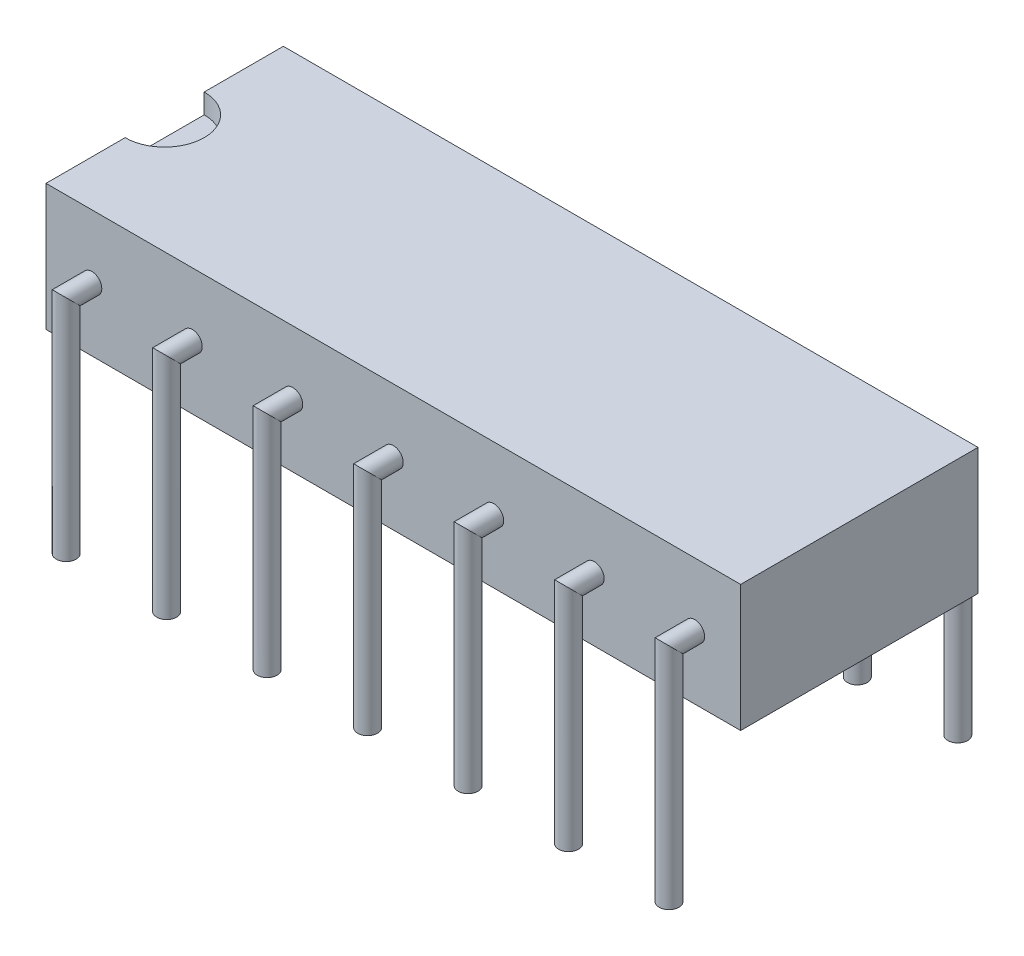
from build123d import *

# Parameters (mm, degrees)
ESQUISSE1_W                          = 6
ESQUISSE1_H                          = 3.2
EXTRUSION1_DEPTH                     = 17.56
ENL_V_MAT_EXTRU_1_DEPTH              = 0.5
ESQUISSE3_R                          = 0.25
R_P_TITION_LIN_AIRE1_COUNT           = 7
R_P_TITION_LIN_AIRE1_PITCH           = 2.54
R_P_TITION_LIN_AIRE1_COPY_1_SKETCH_R = 0.25
R_P_TITION_LIN_AIRE1_COPY_2_SKETCH_R = 0.25
R_P_TITION_LIN_AIRE1_COPY_3_SKETCH_R = 0.25
R_P_TITION_LIN_AIRE1_COPY_4_SKETCH_R = 0.25
R_P_TITION_LIN_AIRE1_COPY_5_SKETCH_R = 0.25
R_P_TITION_LIN_AIRE1_COPY_6_SKETCH_R = 0.25


with BuildPart() as part:
    # Esquisse1 → Extrusion1 (new body)
    with BuildSketch(Plane(origin=(0, 0, 0), x_dir=(0, 0, -1), z_dir=(1, 0, 0))):
        with Locations((0, 1.6)):
            Rectangle(ESQUISSE1_W, ESQUISSE1_H)
    extrude(amount=EXTRUSION1_DEPTH)

    # Esquisse2 → Enl_v. mat.-Extru.1 (cut)
    with BuildSketch(Plane(origin=(0, 3.2, 0), x_dir=(-1, 0, 0), z_dir=(0, 1, 0))):
        with BuildLine():
            Line((0, -1), (0, 1))
            ThreePointArc((0, 1), (-1, 0), (0, -1))
        make_face()
    extrude(amount=-ENL_V_MAT_EXTRU_1_DEPTH, mode=Mode.SUBTRACT)

    # Balayage1: sweep along a path in Esquisse5
    with BuildLine(Plane(origin=(1.16, 0, 0), x_dir=(0, 0, -1), z_dir=(1, 0, 0))) as balayage1_path:
        Line((-3, 1.6), (-3.65, 1.6))
        Line((-3.65, 1.6), (-3.65, -4))
    # Esquisse3 → Balayage1 (sweep)
    with BuildSketch(Plane.XY.offset(3)):
        with Locations((1.16, 1.6)):
            Circle(ESQUISSE3_R)
    balayage1 = sweep(path=balayage1_path.line, transition=Transition.RIGHT)

    # Sym_trie1: Balayage1 across plane
    add(balayage1.mirror(Plane.XY))

    # R_p_tition lin_aire1: Balayage1 ×7
    with Locations(*[(i * R_P_TITION_LIN_AIRE1_PITCH, 0, 0) for i in range(1, R_P_TITION_LIN_AIRE1_COUNT)]):
        add(balayage1)

    # R_p_tition lin_aire1 copy 1: sweep along a path in R_p_tition lin_aire1 copy 1 path
    with BuildLine(Plane(origin=(3.7, 0, 0), x_dir=(0, 0, 1), z_dir=(1, 0, 0))) as r_p_tition_lin_aire1_copy_1_path:
        Line((-3, -1.6), (-3.65, -1.6))
        Line((-3.65, -1.6), (-3.65, 4))
    # R_p_tition lin_aire1 copy 1 sketch → R_p_tition lin_aire1 copy 1 (sweep)
    with BuildSketch(Plane(origin=(2.54, 0, -3), x_dir=(1, 0, 0), z_dir=(0, 0, -1))):
        with Locations((1.16, -1.6)):
            Circle(R_P_TITION_LIN_AIRE1_COPY_1_SKETCH_R)
    sweep(path=r_p_tition_lin_aire1_copy_1_path.line, transition=Transition.RIGHT)

    # R_p_tition lin_aire1 copy 2: sweep along a path in R_p_tition lin_aire1 copy 2 path
    with BuildLine(Plane(origin=(6.24, 0, 0), x_dir=(0, 0, 1), z_dir=(1, 0, 0))) as r_p_tition_lin_aire1_copy_2_path:
        Line((-3, -1.6), (-3.65, -1.6))
        Line((-3.65, -1.6), (-3.65, 4))
    # R_p_tition lin_aire1 copy 2 sketch → R_p_tition lin_aire1 copy 2 (sweep)
    with BuildSketch(Plane(origin=(5.08, 0, -3), x_dir=(1, 0, 0), z_dir=(0, 0, -1))):
        with Locations((1.16, -1.6)):
            Circle(R_P_TITION_LIN_AIRE1_COPY_2_SKETCH_R)
    sweep(path=r_p_tition_lin_aire1_copy_2_path.line, transition=Transition.RIGHT)

    # R_p_tition lin_aire1 copy 3: sweep along a path in R_p_tition lin_aire1 copy 3 path
    with BuildLine(Plane(origin=(8.78, 0, 0), x_dir=(0, 0, 1), z_dir=(1, 0, 0))) as r_p_tition_lin_aire1_copy_3_path:
        Line((-3, -1.6), (-3.65, -1.6))
        Line((-3.65, -1.6), (-3.65, 4))
    # R_p_tition lin_aire1 copy 3 sketch → R_p_tition lin_aire1 copy 3 (sweep)
    with BuildSketch(Plane(origin=(7.62, 0, -3), x_dir=(1, 0, 0), z_dir=(0, 0, -1))):
        with Locations((1.16, -1.6)):
            Circle(R_P_TITION_LIN_AIRE1_COPY_3_SKETCH_R)
    sweep(path=r_p_tition_lin_aire1_copy_3_path.line, transition=Transition.RIGHT)

    # R_p_tition lin_aire1 copy 4: sweep along a path in R_p_tition lin_aire1 copy 4 path
    with BuildLine(Plane(origin=(11.32, 0, 0), x_dir=(0, 0, 1), z_dir=(1, 0, 0))) as r_p_tition_lin_aire1_copy_4_path:
        Line((-3, -1.6), (-3.65, -1.6))
        Line((-3.65, -1.6), (-3.65, 4))
    # R_p_tition lin_aire1 copy 4 sketch → R_p_tition lin_aire1 copy 4 (sweep)
    with BuildSketch(Plane(origin=(10.16, 0, -3), x_dir=(1, 0, 0), z_dir=(0, 0, -1))):
        with Locations((1.16, -1.6)):
            Circle(R_P_TITION_LIN_AIRE1_COPY_4_SKETCH_R)
    sweep(path=r_p_tition_lin_aire1_copy_4_path.line, transition=Transition.RIGHT)

    # R_p_tition lin_aire1 copy 5: sweep along a path in R_p_tition lin_aire1 copy 5 path
    with BuildLine(Plane(origin=(13.86, 0, 0), x_dir=(0, 0, 1), z_dir=(1, 0, 0))) as r_p_tition_lin_aire1_copy_5_path:
        Line((-3, -1.6), (-3.65, -1.6))
        Line((-3.65, -1.6), (-3.65, 4))
    # R_p_tition lin_aire1 copy 5 sketch → R_p_tition lin_aire1 copy 5 (sweep)
    with BuildSketch(Plane(origin=(12.7, 0, -3), x_dir=(1, 0, 0), z_dir=(0, 0, -1))):
        with Locations((1.16, -1.6)):
            Circle(R_P_TITION_LIN_AIRE1_COPY_5_SKETCH_R)
    sweep(path=r_p_tition_lin_aire1_copy_5_path.line, transition=Transition.RIGHT)

    # R_p_tition lin_aire1 copy 6: sweep along a path in R_p_tition lin_aire1 copy 6 path
    with BuildLine(Plane(origin=(16.4, 0, 0), x_dir=(0, 0, 1), z_dir=(1, 0, 0))) as r_p_tition_lin_aire1_copy_6_path:
        Line((-3, -1.6), (-3.65, -1.6))
        Line((-3.65, -1.6), (-3.65, 4))
    # R_p_tition lin_aire1 copy 6 sketch → R_p_tition lin_aire1 copy 6 (sweep)
    with BuildSketch(Plane(origin=(15.24, 0, -3), x_dir=(1, 0, 0), z_dir=(0, 0, -1))):
        with Locations((1.16, -1.6)):
            Circle(R_P_TITION_LIN_AIRE1_COPY_6_SKETCH_R)
    sweep(path=r_p_tition_lin_aire1_copy_6_path.line, transition=Transition.RIGHT)


solid = part.part
